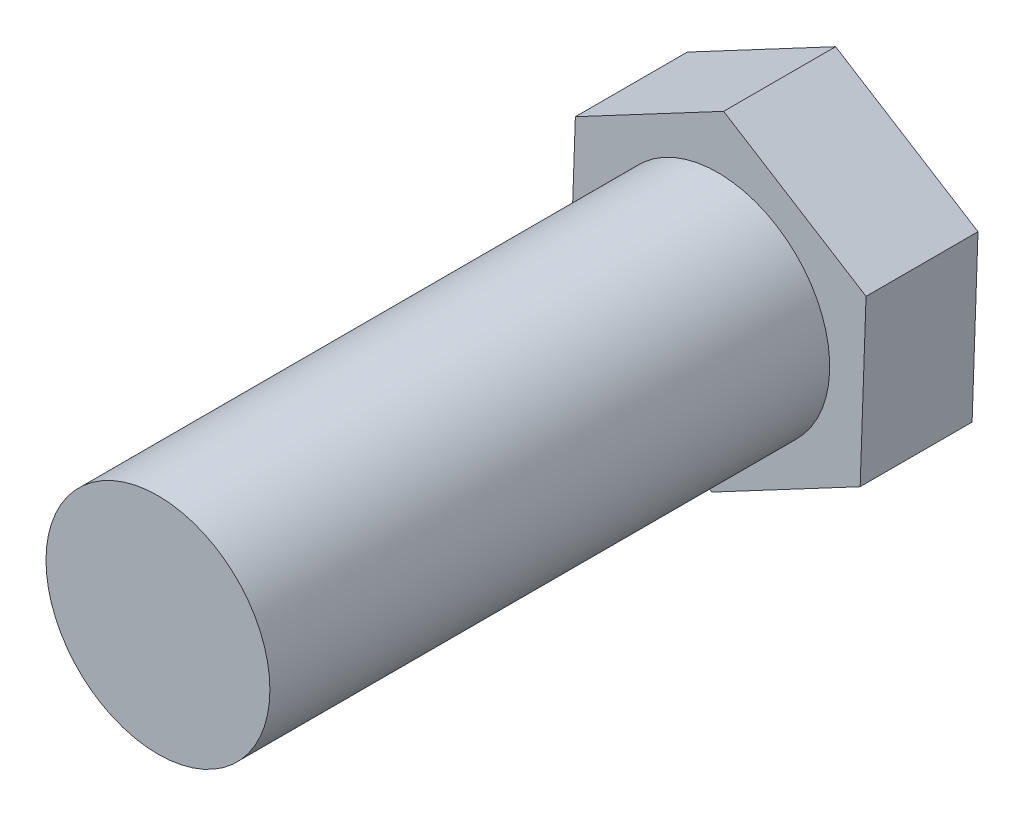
ISO-10303-21;
HEADER;
FILE_DESCRIPTION(('STEP AP214'),'2;1');
FILE_NAME('part.step','',(''),(''),'','','');
FILE_SCHEMA(('AUTOMOTIVE_DESIGN { 1 0 10303 214 1 1 1 1 }'));
ENDSEC;
DATA;
#1=APPLICATION_CONTEXT('core data for automotive mechanical design processes');
#2=APPLICATION_PROTOCOL_DEFINITION('international standard','automotive_design',2000,#1);
#3=PRODUCT_CONTEXT('',#1,'mechanical');
#4=PRODUCT('Part','Part','',(#3));
#5=PRODUCT_RELATED_PRODUCT_CATEGORY('part','',(#4));
#6=PRODUCT_DEFINITION_FORMATION('','',#4);
#7=PRODUCT_DEFINITION_CONTEXT('part definition',#1,'design');
#8=PRODUCT_DEFINITION('design','',#6,#7);
#9=PRODUCT_DEFINITION_SHAPE('','',#8);
#10=(LENGTH_UNIT() NAMED_UNIT(*) SI_UNIT(.MILLI.,.METRE.));
#11=(NAMED_UNIT(*) PLANE_ANGLE_UNIT() SI_UNIT($,.RADIAN.));
#12=(NAMED_UNIT(*) SI_UNIT($,.STERADIAN.) SOLID_ANGLE_UNIT());
#13=UNCERTAINTY_MEASURE_WITH_UNIT(LENGTH_MEASURE(1.E-05),#10,'distance_accuracy_value','');
#14=(GEOMETRIC_REPRESENTATION_CONTEXT(3) GLOBAL_UNCERTAINTY_ASSIGNED_CONTEXT((#13)) GLOBAL_UNIT_ASSIGNED_CONTEXT((#10,
#11,#12)) REPRESENTATION_CONTEXT('',''));
#15=CARTESIAN_POINT('',(0.,0.,0.));
#16=DIRECTION('',(0.,0.,1.));
#17=DIRECTION('',(1.,0.,0.));
#18=AXIS2_PLACEMENT_3D('',#15,#16,#17);
#19=CARTESIAN_POINT('',(0.,0.,30.));
#20=DIRECTION('',(0.,0.,-1.));
#21=DIRECTION('',(-1.,0.,0.));
#22=AXIS2_PLACEMENT_3D('',#19,#20,#21);
#23=CYLINDRICAL_SURFACE('',#22,5.);
#24=CARTESIAN_POINT('',(0.,0.,30.));
#25=DIRECTION('',(0.,0.,1.));
#26=DIRECTION('',(1.,0.,0.));
#27=AXIS2_PLACEMENT_3D('',#24,#25,#26);
#28=CIRCLE('',#27,5.);
#29=CARTESIAN_POINT('',(5.,0.,30.));
#30=VERTEX_POINT('',#29);
#31=EDGE_CURVE('E39',#30,#30,#28,.T.);
#32=ORIENTED_EDGE('',*,*,#31,.F.);
#33=EDGE_LOOP('',(#32));
#34=FACE_BOUND('',#33,.T.);
#35=CARTESIAN_POINT('',(0.,0.,5.));
#36=DIRECTION('',(0.,0.,-1.));
#37=DIRECTION('',(-1.,0.,0.));
#38=AXIS2_PLACEMENT_3D('',#35,#36,#37);
#39=CIRCLE('',#38,5.);
#40=CARTESIAN_POINT('',(-5.,0.,5.));
#41=VERTEX_POINT('',#40);
#42=EDGE_CURVE('E11',#41,#41,#39,.T.);
#43=ORIENTED_EDGE('',*,*,#42,.F.);
#44=EDGE_LOOP('',(#43));
#45=FACE_BOUND('',#44,.T.);
#46=ADVANCED_FACE('F31',(#34,#45),#23,.T.);
#47=CARTESIAN_POINT('',(0.,0.,30.));
#48=DIRECTION('',(0.,0.,1.));
#49=DIRECTION('',(1.,0.,0.));
#50=AXIS2_PLACEMENT_3D('',#47,#48,#49);
#51=PLANE('',#50);
#52=ORIENTED_EDGE('',*,*,#31,.T.);
#53=EDGE_LOOP('',(#52));
#54=FACE_BOUND('',#53,.T.);
#55=ADVANCED_FACE('F143',(#54),#51,.T.);
#56=CARTESIAN_POINT('',(0.263497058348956,7.4953698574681,5.));
#57=DIRECTION('',(0.,0.,-1.));
#58=DIRECTION('',(-1.,0.,0.));
#59=AXIS2_PLACEMENT_3D('',#56,#57,#58);
#60=PLANE('',#59);
#61=DIRECTION('',(0.8830572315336,0.469265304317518,0.));
#62=VECTOR('',#61,1.);
#63=CARTESIAN_POINT('',(-6.35943217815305,3.97588007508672,5.));
#64=LINE('',#63,#62);
#65=CARTESIAN_POINT('',(-6.35943217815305,3.97588007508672,5.));
#66=VERTEX_POINT('',#65);
#67=CARTESIAN_POINT('',(0.263497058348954,7.49536985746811,5.));
#68=VERTEX_POINT('',#67);
#69=EDGE_CURVE('E134',#66,#68,#64,.T.);
#70=ORIENTED_EDGE('',*,*,#69,.F.);
#71=DIRECTION('',(0.0351329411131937,0.999382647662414,0.));
#72=VECTOR('',#71,1.);
#73=CARTESIAN_POINT('',(-6.622929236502,-3.51948978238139,5.));
#74=LINE('',#73,#72);
#75=CARTESIAN_POINT('',(-6.622929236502,-3.51948978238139,5.));
#76=VERTEX_POINT('',#75);
#77=EDGE_CURVE('E109',#76,#66,#74,.T.);
#78=ORIENTED_EDGE('',*,*,#77,.F.);
#79=DIRECTION('',(-0.847924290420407,0.530117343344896,0.));
#80=VECTOR('',#79,1.);
#81=CARTESIAN_POINT('',(-0.263497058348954,-7.4953698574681,5.));
#82=LINE('',#81,#80);
#83=CARTESIAN_POINT('',(-0.263497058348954,-7.4953698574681,5.));
#84=VERTEX_POINT('',#83);
#85=EDGE_CURVE('E93',#84,#76,#82,.T.);
#86=ORIENTED_EDGE('',*,*,#85,.F.);
#87=DIRECTION('',(-0.8830572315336,-0.469265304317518,0.));
#88=VECTOR('',#87,1.);
#89=CARTESIAN_POINT('',(6.35943217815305,-3.97588007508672,5.));
#90=LINE('',#89,#88);
#91=CARTESIAN_POINT('',(6.35943217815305,-3.97588007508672,5.));
#92=VERTEX_POINT('',#91);
#93=EDGE_CURVE('E107',#92,#84,#90,.T.);
#94=ORIENTED_EDGE('',*,*,#93,.F.);
#95=DIRECTION('',(-0.0351329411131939,-0.999382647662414,0.));
#96=VECTOR('',#95,1.);
#97=CARTESIAN_POINT('',(6.622929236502,3.51948978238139,5.));
#98=LINE('',#97,#96);
#99=CARTESIAN_POINT('',(6.622929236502,3.51948978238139,5.));
#100=VERTEX_POINT('',#99);
#101=EDGE_CURVE('E112',#100,#92,#98,.T.);
#102=ORIENTED_EDGE('',*,*,#101,.F.);
#103=DIRECTION('',(0.847924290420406,-0.530117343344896,0.));
#104=VECTOR('',#103,1.);
#105=CARTESIAN_POINT('',(0.263497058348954,7.49536985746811,5.));
#106=LINE('',#105,#104);
#107=EDGE_CURVE('E114',#68,#100,#106,.T.);
#108=ORIENTED_EDGE('',*,*,#107,.F.);
#109=EDGE_LOOP('',(#70,#78,#86,#94,#102,#108));
#110=FACE_BOUND('',#109,.T.);
#111=ORIENTED_EDGE('',*,*,#42,.T.);
#112=EDGE_LOOP('',(#111));
#113=FACE_BOUND('',#112,.T.);
#114=ADVANCED_FACE('F104',(#110,#113),#60,.F.);
#115=CARTESIAN_POINT('',(-6.35943217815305,3.97588007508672,5.));
#116=DIRECTION('',(-0.469265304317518,0.8830572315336,0.));
#117=DIRECTION('',(-0.883057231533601,-0.469265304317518,0.));
#118=AXIS2_PLACEMENT_3D('',#115,#116,#117);
#119=PLANE('',#118);
#120=DIRECTION('',(0.8830572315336,0.469265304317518,0.));
#121=VECTOR('',#120,1.);
#122=CARTESIAN_POINT('',(-6.35943217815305,3.97588007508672,0.));
#123=LINE('',#122,#121);
#124=CARTESIAN_POINT('',(-6.35943217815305,3.97588007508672,0.));
#125=VERTEX_POINT('',#124);
#126=CARTESIAN_POINT('',(0.263497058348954,7.49536985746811,0.));
#127=VERTEX_POINT('',#126);
#128=EDGE_CURVE('E119',#125,#127,#123,.T.);
#129=ORIENTED_EDGE('',*,*,#128,.F.);
#130=DIRECTION('',(0.,0.,-1.));
#131=VECTOR('',#130,1.);
#132=CARTESIAN_POINT('',(-6.35943217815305,3.97588007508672,5.));
#133=LINE('',#132,#131);
#134=EDGE_CURVE('E47',#66,#125,#133,.T.);
#135=ORIENTED_EDGE('',*,*,#134,.F.);
#136=ORIENTED_EDGE('',*,*,#69,.T.);
#137=DIRECTION('',(0.,0.,-1.));
#138=VECTOR('',#137,1.);
#139=CARTESIAN_POINT('',(0.263497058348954,7.49536985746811,5.));
#140=LINE('',#139,#138);
#141=EDGE_CURVE('E82',#68,#127,#140,.T.);
#142=ORIENTED_EDGE('',*,*,#141,.T.);
#143=EDGE_LOOP('',(#129,#135,#136,#142));
#144=FACE_BOUND('',#143,.T.);
#145=ADVANCED_FACE('F149',(#144),#119,.T.);
#146=CARTESIAN_POINT('',(-6.622929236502,-3.51948978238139,5.));
#147=DIRECTION('',(-0.999382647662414,0.0351329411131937,0.));
#148=DIRECTION('',(-0.0351329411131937,-0.999382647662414,0.));
#149=AXIS2_PLACEMENT_3D('',#146,#147,#148);
#150=PLANE('',#149);
#151=DIRECTION('',(0.0351329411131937,0.999382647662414,0.));
#152=VECTOR('',#151,1.);
#153=CARTESIAN_POINT('',(-6.622929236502,-3.51948978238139,0.));
#154=LINE('',#153,#152);
#155=CARTESIAN_POINT('',(-6.622929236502,-3.51948978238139,0.));
#156=VERTEX_POINT('',#155);
#157=EDGE_CURVE('E131',#156,#125,#154,.T.);
#158=ORIENTED_EDGE('',*,*,#157,.F.);
#159=DIRECTION('',(0.,0.,-1.));
#160=VECTOR('',#159,1.);
#161=CARTESIAN_POINT('',(-6.622929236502,-3.51948978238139,5.));
#162=LINE('',#161,#160);
#163=EDGE_CURVE('E70',#76,#156,#162,.T.);
#164=ORIENTED_EDGE('',*,*,#163,.F.);
#165=ORIENTED_EDGE('',*,*,#77,.T.);
#166=ORIENTED_EDGE('',*,*,#134,.T.);
#167=EDGE_LOOP('',(#158,#164,#165,#166));
#168=FACE_BOUND('',#167,.T.);
#169=ADVANCED_FACE('F155',(#168),#150,.T.);
#170=CARTESIAN_POINT('',(-0.263497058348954,-7.4953698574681,5.));
#171=DIRECTION('',(-0.530117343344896,-0.847924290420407,0.));
#172=DIRECTION('',(0.847924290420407,-0.530117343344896,0.));
#173=AXIS2_PLACEMENT_3D('',#170,#171,#172);
#174=PLANE('',#173);
#175=DIRECTION('',(-0.847924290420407,0.530117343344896,0.));
#176=VECTOR('',#175,1.);
#177=CARTESIAN_POINT('',(-0.263497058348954,-7.4953698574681,0.));
#178=LINE('',#177,#176);
#179=CARTESIAN_POINT('',(-0.263497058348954,-7.4953698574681,0.));
#180=VERTEX_POINT('',#179);
#181=EDGE_CURVE('E95',#180,#156,#178,.T.);
#182=ORIENTED_EDGE('',*,*,#181,.F.);
#183=DIRECTION('',(0.,0.,-1.));
#184=VECTOR('',#183,1.);
#185=CARTESIAN_POINT('',(-0.263497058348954,-7.4953698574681,5.));
#186=LINE('',#185,#184);
#187=EDGE_CURVE('E90',#84,#180,#186,.T.);
#188=ORIENTED_EDGE('',*,*,#187,.F.);
#189=ORIENTED_EDGE('',*,*,#85,.T.);
#190=ORIENTED_EDGE('',*,*,#163,.T.);
#191=EDGE_LOOP('',(#182,#188,#189,#190));
#192=FACE_BOUND('',#191,.T.);
#193=ADVANCED_FACE('F92',(#192),#174,.T.);
#194=CARTESIAN_POINT('',(6.35943217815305,-3.97588007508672,5.));
#195=DIRECTION('',(0.469265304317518,-0.8830572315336,0.));
#196=DIRECTION('',(0.883057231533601,0.469265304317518,0.));
#197=AXIS2_PLACEMENT_3D('',#194,#195,#196);
#198=PLANE('',#197);
#199=DIRECTION('',(-0.8830572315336,-0.469265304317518,0.));
#200=VECTOR('',#199,1.);
#201=CARTESIAN_POINT('',(6.35943217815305,-3.97588007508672,0.));
#202=LINE('',#201,#200);
#203=CARTESIAN_POINT('',(6.35943217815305,-3.97588007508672,0.));
#204=VERTEX_POINT('',#203);
#205=EDGE_CURVE('E128',#204,#180,#202,.T.);
#206=ORIENTED_EDGE('',*,*,#205,.F.);
#207=DIRECTION('',(0.,0.,-1.));
#208=VECTOR('',#207,1.);
#209=CARTESIAN_POINT('',(6.35943217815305,-3.97588007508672,5.));
#210=LINE('',#209,#208);
#211=EDGE_CURVE('E100',#92,#204,#210,.T.);
#212=ORIENTED_EDGE('',*,*,#211,.F.);
#213=ORIENTED_EDGE('',*,*,#93,.T.);
#214=ORIENTED_EDGE('',*,*,#187,.T.);
#215=EDGE_LOOP('',(#206,#212,#213,#214));
#216=FACE_BOUND('',#215,.T.);
#217=ADVANCED_FACE('F111',(#216),#198,.T.);
#218=CARTESIAN_POINT('',(6.622929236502,3.51948978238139,5.));
#219=DIRECTION('',(0.999382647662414,-0.0351329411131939,0.));
#220=DIRECTION('',(0.0351329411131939,0.999382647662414,0.));
#221=AXIS2_PLACEMENT_3D('',#218,#219,#220);
#222=PLANE('',#221);
#223=DIRECTION('',(-0.0351329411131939,-0.999382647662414,0.));
#224=VECTOR('',#223,1.);
#225=CARTESIAN_POINT('',(6.622929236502,3.51948978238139,0.));
#226=LINE('',#225,#224);
#227=CARTESIAN_POINT('',(6.622929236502,3.51948978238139,0.));
#228=VERTEX_POINT('',#227);
#229=EDGE_CURVE('E125',#228,#204,#226,.T.);
#230=ORIENTED_EDGE('',*,*,#229,.F.);
#231=DIRECTION('',(0.,0.,-1.));
#232=VECTOR('',#231,1.);
#233=CARTESIAN_POINT('',(6.622929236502,3.51948978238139,5.));
#234=LINE('',#233,#232);
#235=EDGE_CURVE('E138',#100,#228,#234,.T.);
#236=ORIENTED_EDGE('',*,*,#235,.F.);
#237=ORIENTED_EDGE('',*,*,#101,.T.);
#238=ORIENTED_EDGE('',*,*,#211,.T.);
#239=EDGE_LOOP('',(#230,#236,#237,#238));
#240=FACE_BOUND('',#239,.T.);
#241=ADVANCED_FACE('F165',(#240),#222,.T.);
#242=CARTESIAN_POINT('',(0.263497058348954,7.49536985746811,5.));
#243=DIRECTION('',(0.530117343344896,0.847924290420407,0.));
#244=DIRECTION('',(-0.847924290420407,0.530117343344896,0.));
#245=AXIS2_PLACEMENT_3D('',#242,#243,#244);
#246=PLANE('',#245);
#247=DIRECTION('',(0.847924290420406,-0.530117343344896,0.));
#248=VECTOR('',#247,1.);
#249=CARTESIAN_POINT('',(0.263497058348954,7.49536985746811,0.));
#250=LINE('',#249,#248);
#251=EDGE_CURVE('E122',#127,#228,#250,.T.);
#252=ORIENTED_EDGE('',*,*,#251,.F.);
#253=ORIENTED_EDGE('',*,*,#141,.F.);
#254=ORIENTED_EDGE('',*,*,#107,.T.);
#255=ORIENTED_EDGE('',*,*,#235,.T.);
#256=EDGE_LOOP('',(#252,#253,#254,#255));
#257=FACE_BOUND('',#256,.T.);
#258=ADVANCED_FACE('F168',(#257),#246,.T.);
#259=CARTESIAN_POINT('',(0.,0.,0.));
#260=DIRECTION('',(0.,0.,1.));
#261=DIRECTION('',(1.,0.,0.));
#262=AXIS2_PLACEMENT_3D('',#259,#260,#261);
#263=PLANE('',#262);
#264=ORIENTED_EDGE('',*,*,#128,.T.);
#265=ORIENTED_EDGE('',*,*,#251,.T.);
#266=ORIENTED_EDGE('',*,*,#229,.T.);
#267=ORIENTED_EDGE('',*,*,#205,.T.);
#268=ORIENTED_EDGE('',*,*,#181,.T.);
#269=ORIENTED_EDGE('',*,*,#157,.T.);
#270=EDGE_LOOP('',(#264,#265,#266,#267,#268,#269));
#271=FACE_BOUND('',#270,.T.);
#272=ADVANCED_FACE('F171',(#271),#263,.F.);
#273=CLOSED_SHELL('',(#46,#55,#114,#145,#169,#193,#217,#241,#258,#272));
#274=MANIFOLD_SOLID_BREP('B2',#273);
#275=ADVANCED_BREP_SHAPE_REPRESENTATION('',(#18,#274),#14);
#276=SHAPE_DEFINITION_REPRESENTATION(#9,#275);
ENDSEC;
END-ISO-10303-21;
